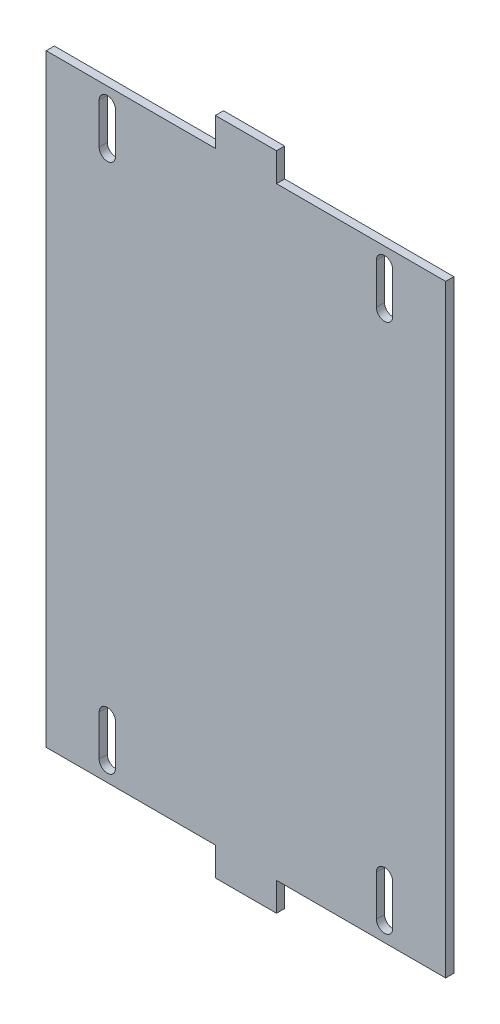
ISO-10303-21;
HEADER;
FILE_DESCRIPTION(('STEP AP214'),'2;1');
FILE_NAME('part.step','',(''),(''),'','','');
FILE_SCHEMA(('AUTOMOTIVE_DESIGN { 1 0 10303 214 1 1 1 1 }'));
ENDSEC;
DATA;
#1=APPLICATION_CONTEXT('core data for automotive mechanical design processes');
#2=APPLICATION_PROTOCOL_DEFINITION('international standard','automotive_design',2000,#1);
#3=PRODUCT_CONTEXT('',#1,'mechanical');
#4=PRODUCT('Part','Part','',(#3));
#5=PRODUCT_RELATED_PRODUCT_CATEGORY('part','',(#4));
#6=PRODUCT_DEFINITION_FORMATION('','',#4);
#7=PRODUCT_DEFINITION_CONTEXT('part definition',#1,'design');
#8=PRODUCT_DEFINITION('design','',#6,#7);
#9=PRODUCT_DEFINITION_SHAPE('','',#8);
#10=(LENGTH_UNIT() NAMED_UNIT(*) SI_UNIT(.MILLI.,.METRE.));
#11=(NAMED_UNIT(*) PLANE_ANGLE_UNIT() SI_UNIT($,.RADIAN.));
#12=(NAMED_UNIT(*) SI_UNIT($,.STERADIAN.) SOLID_ANGLE_UNIT());
#13=UNCERTAINTY_MEASURE_WITH_UNIT(LENGTH_MEASURE(1.E-05),#10,'distance_accuracy_value','');
#14=(GEOMETRIC_REPRESENTATION_CONTEXT(3) GLOBAL_UNCERTAINTY_ASSIGNED_CONTEXT((#13)) GLOBAL_UNIT_ASSIGNED_CONTEXT((#10,
#11,#12)) REPRESENTATION_CONTEXT('',''));
#15=CARTESIAN_POINT('',(0.,0.,0.));
#16=DIRECTION('',(0.,0.,1.));
#17=DIRECTION('',(1.,0.,0.));
#18=AXIS2_PLACEMENT_3D('',#15,#16,#17);
#19=CARTESIAN_POINT('',(-49.,74.,2.));
#20=DIRECTION('',(0.,-1.,0.));
#21=DIRECTION('',(0.,0.,-1.));
#22=AXIS2_PLACEMENT_3D('',#19,#20,#21);
#23=PLANE('',#22);
#24=DIRECTION('',(-1.,0.,0.));
#25=VECTOR('',#24,1.);
#26=CARTESIAN_POINT('',(-49.,74.,0.));
#27=LINE('',#26,#25);
#28=CARTESIAN_POINT('',(-7.49999999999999,74.,0.));
#29=VERTEX_POINT('',#28);
#30=CARTESIAN_POINT('',(-49.,74.,0.));
#31=VERTEX_POINT('',#30);
#32=EDGE_CURVE('E284',#29,#31,#27,.T.);
#33=ORIENTED_EDGE('',*,*,#32,.T.);
#34=DIRECTION('',(0.,0.,-1.));
#35=VECTOR('',#34,1.);
#36=CARTESIAN_POINT('',(-49.,74.,2.));
#37=LINE('',#36,#35);
#38=CARTESIAN_POINT('',(-49.,74.,2.));
#39=VERTEX_POINT('',#38);
#40=EDGE_CURVE('E373',#39,#31,#37,.T.);
#41=ORIENTED_EDGE('',*,*,#40,.F.);
#42=DIRECTION('',(-1.,0.,0.));
#43=VECTOR('',#42,1.);
#44=CARTESIAN_POINT('',(-49.,74.,2.));
#45=LINE('',#44,#43);
#46=CARTESIAN_POINT('',(-7.49999999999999,74.,2.));
#47=VERTEX_POINT('',#46);
#48=EDGE_CURVE('E315',#47,#39,#45,.T.);
#49=ORIENTED_EDGE('',*,*,#48,.F.);
#50=DIRECTION('',(0.,0.,-1.));
#51=VECTOR('',#50,1.);
#52=CARTESIAN_POINT('',(-7.49999999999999,74.,2.));
#53=LINE('',#52,#51);
#54=EDGE_CURVE('E340',#47,#29,#53,.T.);
#55=ORIENTED_EDGE('',*,*,#54,.T.);
#56=EDGE_LOOP('',(#33,#41,#49,#55));
#57=FACE_BOUND('',#56,.T.);
#58=ADVANCED_FACE('F30',(#57),#23,.F.);
#59=CARTESIAN_POINT('',(-49.,-74.,2.));
#60=DIRECTION('',(1.,0.,0.));
#61=DIRECTION('',(0.,0.,-1.));
#62=AXIS2_PLACEMENT_3D('',#59,#60,#61);
#63=PLANE('',#62);
#64=DIRECTION('',(0.,-1.,0.));
#65=VECTOR('',#64,1.);
#66=CARTESIAN_POINT('',(-49.,-74.,0.));
#67=LINE('',#66,#65);
#68=CARTESIAN_POINT('',(-49.,-74.,0.));
#69=VERTEX_POINT('',#68);
#70=EDGE_CURVE('E293',#31,#69,#67,.T.);
#71=ORIENTED_EDGE('',*,*,#70,.T.);
#72=DIRECTION('',(0.,0.,-1.));
#73=VECTOR('',#72,1.);
#74=CARTESIAN_POINT('',(-49.,-74.,2.));
#75=LINE('',#74,#73);
#76=CARTESIAN_POINT('',(-49.,-74.,2.));
#77=VERTEX_POINT('',#76);
#78=EDGE_CURVE('E370',#77,#69,#75,.T.);
#79=ORIENTED_EDGE('',*,*,#78,.F.);
#80=DIRECTION('',(0.,-1.,0.));
#81=VECTOR('',#80,1.);
#82=CARTESIAN_POINT('',(-49.,-74.,2.));
#83=LINE('',#82,#81);
#84=EDGE_CURVE('E318',#39,#77,#83,.T.);
#85=ORIENTED_EDGE('',*,*,#84,.F.);
#86=ORIENTED_EDGE('',*,*,#40,.T.);
#87=EDGE_LOOP('',(#71,#79,#85,#86));
#88=FACE_BOUND('',#87,.T.);
#89=ADVANCED_FACE('F450',(#88),#63,.F.);
#90=CARTESIAN_POINT('',(-49.,-74.,2.));
#91=DIRECTION('',(0.,1.,0.));
#92=DIRECTION('',(0.,0.,1.));
#93=AXIS2_PLACEMENT_3D('',#90,#91,#92);
#94=PLANE('',#93);
#95=DIRECTION('',(1.,0.,0.));
#96=VECTOR('',#95,1.);
#97=CARTESIAN_POINT('',(-49.,-74.,0.));
#98=LINE('',#97,#96);
#99=CARTESIAN_POINT('',(-7.49999999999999,-74.,0.));
#100=VERTEX_POINT('',#99);
#101=EDGE_CURVE('E295',#69,#100,#98,.T.);
#102=ORIENTED_EDGE('',*,*,#101,.T.);
#103=DIRECTION('',(0.,0.,-1.));
#104=VECTOR('',#103,1.);
#105=CARTESIAN_POINT('',(-7.49999999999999,-74.,2.));
#106=LINE('',#105,#104);
#107=CARTESIAN_POINT('',(-7.49999999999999,-74.,2.));
#108=VERTEX_POINT('',#107);
#109=EDGE_CURVE('E367',#108,#100,#106,.T.);
#110=ORIENTED_EDGE('',*,*,#109,.F.);
#111=DIRECTION('',(1.,0.,0.));
#112=VECTOR('',#111,1.);
#113=CARTESIAN_POINT('',(-49.,-74.,2.));
#114=LINE('',#113,#112);
#115=EDGE_CURVE('E320',#77,#108,#114,.T.);
#116=ORIENTED_EDGE('',*,*,#115,.F.);
#117=ORIENTED_EDGE('',*,*,#78,.T.);
#118=EDGE_LOOP('',(#102,#110,#116,#117));
#119=FACE_BOUND('',#118,.T.);
#120=ADVANCED_FACE('F456',(#119),#94,.F.);
#121=CARTESIAN_POINT('',(-7.49999999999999,-74.,2.));
#122=DIRECTION('',(1.,0.,0.));
#123=DIRECTION('',(0.,0.,-1.));
#124=AXIS2_PLACEMENT_3D('',#121,#122,#123);
#125=PLANE('',#124);
#126=DIRECTION('',(0.,-1.,0.));
#127=VECTOR('',#126,1.);
#128=CARTESIAN_POINT('',(-7.49999999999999,-74.,0.));
#129=LINE('',#128,#127);
#130=CARTESIAN_POINT('',(-7.49999999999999,-81.,0.));
#131=VERTEX_POINT('',#130);
#132=EDGE_CURVE('E297',#100,#131,#129,.T.);
#133=ORIENTED_EDGE('',*,*,#132,.T.);
#134=DIRECTION('',(0.,0.,-1.));
#135=VECTOR('',#134,1.);
#136=CARTESIAN_POINT('',(-7.49999999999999,-81.,2.));
#137=LINE('',#136,#135);
#138=CARTESIAN_POINT('',(-7.49999999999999,-81.,2.));
#139=VERTEX_POINT('',#138);
#140=EDGE_CURVE('E364',#139,#131,#137,.T.);
#141=ORIENTED_EDGE('',*,*,#140,.F.);
#142=DIRECTION('',(0.,-1.,0.));
#143=VECTOR('',#142,1.);
#144=CARTESIAN_POINT('',(-7.49999999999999,-74.,2.));
#145=LINE('',#144,#143);
#146=EDGE_CURVE('E322',#108,#139,#145,.T.);
#147=ORIENTED_EDGE('',*,*,#146,.F.);
#148=ORIENTED_EDGE('',*,*,#109,.T.);
#149=EDGE_LOOP('',(#133,#141,#147,#148));
#150=FACE_BOUND('',#149,.T.);
#151=ADVANCED_FACE('F544',(#150),#125,.F.);
#152=CARTESIAN_POINT('',(-7.49999999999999,-81.,2.));
#153=DIRECTION('',(0.,1.,0.));
#154=DIRECTION('',(0.,0.,1.));
#155=AXIS2_PLACEMENT_3D('',#152,#153,#154);
#156=PLANE('',#155);
#157=DIRECTION('',(1.,0.,0.));
#158=VECTOR('',#157,1.);
#159=CARTESIAN_POINT('',(-7.49999999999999,-81.,0.));
#160=LINE('',#159,#158);
#161=CARTESIAN_POINT('',(7.49999999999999,-81.,0.));
#162=VERTEX_POINT('',#161);
#163=EDGE_CURVE('E299',#131,#162,#160,.T.);
#164=ORIENTED_EDGE('',*,*,#163,.T.);
#165=DIRECTION('',(0.,0.,-1.));
#166=VECTOR('',#165,1.);
#167=CARTESIAN_POINT('',(7.49999999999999,-81.,2.));
#168=LINE('',#167,#166);
#169=CARTESIAN_POINT('',(7.49999999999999,-81.,2.));
#170=VERTEX_POINT('',#169);
#171=EDGE_CURVE('E361',#170,#162,#168,.T.);
#172=ORIENTED_EDGE('',*,*,#171,.F.);
#173=DIRECTION('',(1.,0.,0.));
#174=VECTOR('',#173,1.);
#175=CARTESIAN_POINT('',(-7.49999999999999,-81.,2.));
#176=LINE('',#175,#174);
#177=EDGE_CURVE('E324',#139,#170,#176,.T.);
#178=ORIENTED_EDGE('',*,*,#177,.F.);
#179=ORIENTED_EDGE('',*,*,#140,.T.);
#180=EDGE_LOOP('',(#164,#172,#178,#179));
#181=FACE_BOUND('',#180,.T.);
#182=ADVANCED_FACE('F540',(#181),#156,.F.);
#183=CARTESIAN_POINT('',(7.49999999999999,-74.,2.));
#184=DIRECTION('',(-1.,0.,0.));
#185=DIRECTION('',(0.,0.,1.));
#186=AXIS2_PLACEMENT_3D('',#183,#184,#185);
#187=PLANE('',#186);
#188=DIRECTION('',(0.,1.,0.));
#189=VECTOR('',#188,1.);
#190=CARTESIAN_POINT('',(7.49999999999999,-74.,0.));
#191=LINE('',#190,#189);
#192=CARTESIAN_POINT('',(7.49999999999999,-74.,0.));
#193=VERTEX_POINT('',#192);
#194=EDGE_CURVE('E301',#162,#193,#191,.T.);
#195=ORIENTED_EDGE('',*,*,#194,.T.);
#196=DIRECTION('',(0.,0.,-1.));
#197=VECTOR('',#196,1.);
#198=CARTESIAN_POINT('',(7.49999999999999,-74.,2.));
#199=LINE('',#198,#197);
#200=CARTESIAN_POINT('',(7.49999999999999,-74.,2.));
#201=VERTEX_POINT('',#200);
#202=EDGE_CURVE('E358',#201,#193,#199,.T.);
#203=ORIENTED_EDGE('',*,*,#202,.F.);
#204=DIRECTION('',(0.,1.,0.));
#205=VECTOR('',#204,1.);
#206=CARTESIAN_POINT('',(7.49999999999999,-74.,2.));
#207=LINE('',#206,#205);
#208=EDGE_CURVE('E326',#170,#201,#207,.T.);
#209=ORIENTED_EDGE('',*,*,#208,.F.);
#210=ORIENTED_EDGE('',*,*,#171,.T.);
#211=EDGE_LOOP('',(#195,#203,#209,#210));
#212=FACE_BOUND('',#211,.T.);
#213=ADVANCED_FACE('F536',(#212),#187,.F.);
#214=CARTESIAN_POINT('',(49.,-74.,2.));
#215=DIRECTION('',(0.,1.,0.));
#216=DIRECTION('',(0.,0.,1.));
#217=AXIS2_PLACEMENT_3D('',#214,#215,#216);
#218=PLANE('',#217);
#219=DIRECTION('',(1.,0.,0.));
#220=VECTOR('',#219,1.);
#221=CARTESIAN_POINT('',(49.,-74.,0.));
#222=LINE('',#221,#220);
#223=CARTESIAN_POINT('',(49.,-74.,0.));
#224=VERTEX_POINT('',#223);
#225=EDGE_CURVE('E303',#193,#224,#222,.T.);
#226=ORIENTED_EDGE('',*,*,#225,.T.);
#227=DIRECTION('',(0.,0.,-1.));
#228=VECTOR('',#227,1.);
#229=CARTESIAN_POINT('',(49.,-74.,2.));
#230=LINE('',#229,#228);
#231=CARTESIAN_POINT('',(49.,-74.,2.));
#232=VERTEX_POINT('',#231);
#233=EDGE_CURVE('E355',#232,#224,#230,.T.);
#234=ORIENTED_EDGE('',*,*,#233,.F.);
#235=DIRECTION('',(1.,0.,0.));
#236=VECTOR('',#235,1.);
#237=CARTESIAN_POINT('',(49.,-74.,2.));
#238=LINE('',#237,#236);
#239=EDGE_CURVE('E328',#201,#232,#238,.T.);
#240=ORIENTED_EDGE('',*,*,#239,.F.);
#241=ORIENTED_EDGE('',*,*,#202,.T.);
#242=EDGE_LOOP('',(#226,#234,#240,#241));
#243=FACE_BOUND('',#242,.T.);
#244=ADVANCED_FACE('F532',(#243),#218,.F.);
#245=CARTESIAN_POINT('',(49.,-74.,2.));
#246=DIRECTION('',(-1.,0.,0.));
#247=DIRECTION('',(0.,0.,1.));
#248=AXIS2_PLACEMENT_3D('',#245,#246,#247);
#249=PLANE('',#248);
#250=DIRECTION('',(0.,1.,0.));
#251=VECTOR('',#250,1.);
#252=CARTESIAN_POINT('',(49.,-74.,0.));
#253=LINE('',#252,#251);
#254=CARTESIAN_POINT('',(49.,74.,0.));
#255=VERTEX_POINT('',#254);
#256=EDGE_CURVE('E305',#224,#255,#253,.T.);
#257=ORIENTED_EDGE('',*,*,#256,.T.);
#258=DIRECTION('',(0.,0.,-1.));
#259=VECTOR('',#258,1.);
#260=CARTESIAN_POINT('',(49.,74.,2.));
#261=LINE('',#260,#259);
#262=CARTESIAN_POINT('',(49.,74.,2.));
#263=VERTEX_POINT('',#262);
#264=EDGE_CURVE('E352',#263,#255,#261,.T.);
#265=ORIENTED_EDGE('',*,*,#264,.F.);
#266=DIRECTION('',(0.,1.,0.));
#267=VECTOR('',#266,1.);
#268=CARTESIAN_POINT('',(49.,-74.,2.));
#269=LINE('',#268,#267);
#270=EDGE_CURVE('E330',#232,#263,#269,.T.);
#271=ORIENTED_EDGE('',*,*,#270,.F.);
#272=ORIENTED_EDGE('',*,*,#233,.T.);
#273=EDGE_LOOP('',(#257,#265,#271,#272));
#274=FACE_BOUND('',#273,.T.);
#275=ADVANCED_FACE('F528',(#274),#249,.F.);
#276=CARTESIAN_POINT('',(49.,74.,2.));
#277=DIRECTION('',(0.,-1.,0.));
#278=DIRECTION('',(0.,0.,-1.));
#279=AXIS2_PLACEMENT_3D('',#276,#277,#278);
#280=PLANE('',#279);
#281=DIRECTION('',(-1.,0.,0.));
#282=VECTOR('',#281,1.);
#283=CARTESIAN_POINT('',(49.,74.,0.));
#284=LINE('',#283,#282);
#285=CARTESIAN_POINT('',(7.49999999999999,74.,0.));
#286=VERTEX_POINT('',#285);
#287=EDGE_CURVE('E307',#255,#286,#284,.T.);
#288=ORIENTED_EDGE('',*,*,#287,.T.);
#289=DIRECTION('',(0.,0.,-1.));
#290=VECTOR('',#289,1.);
#291=CARTESIAN_POINT('',(7.49999999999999,74.,2.));
#292=LINE('',#291,#290);
#293=CARTESIAN_POINT('',(7.49999999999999,74.,2.));
#294=VERTEX_POINT('',#293);
#295=EDGE_CURVE('E349',#294,#286,#292,.T.);
#296=ORIENTED_EDGE('',*,*,#295,.F.);
#297=DIRECTION('',(-1.,0.,0.));
#298=VECTOR('',#297,1.);
#299=CARTESIAN_POINT('',(49.,74.,2.));
#300=LINE('',#299,#298);
#301=EDGE_CURVE('E332',#263,#294,#300,.T.);
#302=ORIENTED_EDGE('',*,*,#301,.F.);
#303=ORIENTED_EDGE('',*,*,#264,.T.);
#304=EDGE_LOOP('',(#288,#296,#302,#303));
#305=FACE_BOUND('',#304,.T.);
#306=ADVANCED_FACE('F524',(#305),#280,.F.);
#307=CARTESIAN_POINT('',(7.49999999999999,74.,2.));
#308=DIRECTION('',(-1.,0.,0.));
#309=DIRECTION('',(0.,0.,1.));
#310=AXIS2_PLACEMENT_3D('',#307,#308,#309);
#311=PLANE('',#310);
#312=DIRECTION('',(0.,1.,0.));
#313=VECTOR('',#312,1.);
#314=CARTESIAN_POINT('',(7.49999999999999,74.,0.));
#315=LINE('',#314,#313);
#316=CARTESIAN_POINT('',(7.49999999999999,81.,0.));
#317=VERTEX_POINT('',#316);
#318=EDGE_CURVE('E309',#286,#317,#315,.T.);
#319=ORIENTED_EDGE('',*,*,#318,.T.);
#320=DIRECTION('',(0.,0.,-1.));
#321=VECTOR('',#320,1.);
#322=CARTESIAN_POINT('',(7.49999999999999,81.,2.));
#323=LINE('',#322,#321);
#324=CARTESIAN_POINT('',(7.49999999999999,81.,2.));
#325=VERTEX_POINT('',#324);
#326=EDGE_CURVE('E346',#325,#317,#323,.T.);
#327=ORIENTED_EDGE('',*,*,#326,.F.);
#328=DIRECTION('',(0.,1.,0.));
#329=VECTOR('',#328,1.);
#330=CARTESIAN_POINT('',(7.49999999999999,74.,2.));
#331=LINE('',#330,#329);
#332=EDGE_CURVE('E334',#294,#325,#331,.T.);
#333=ORIENTED_EDGE('',*,*,#332,.F.);
#334=ORIENTED_EDGE('',*,*,#295,.T.);
#335=EDGE_LOOP('',(#319,#327,#333,#334));
#336=FACE_BOUND('',#335,.T.);
#337=ADVANCED_FACE('F520',(#336),#311,.F.);
#338=CARTESIAN_POINT('',(-7.49999999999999,81.,2.));
#339=DIRECTION('',(0.,-1.,0.));
#340=DIRECTION('',(0.,0.,-1.));
#341=AXIS2_PLACEMENT_3D('',#338,#339,#340);
#342=PLANE('',#341);
#343=DIRECTION('',(-1.,0.,0.));
#344=VECTOR('',#343,1.);
#345=CARTESIAN_POINT('',(-7.49999999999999,81.,0.));
#346=LINE('',#345,#344);
#347=CARTESIAN_POINT('',(-7.49999999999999,81.,0.));
#348=VERTEX_POINT('',#347);
#349=EDGE_CURVE('E311',#317,#348,#346,.T.);
#350=ORIENTED_EDGE('',*,*,#349,.T.);
#351=DIRECTION('',(0.,0.,-1.));
#352=VECTOR('',#351,1.);
#353=CARTESIAN_POINT('',(-7.49999999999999,81.,2.));
#354=LINE('',#353,#352);
#355=CARTESIAN_POINT('',(-7.49999999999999,81.,2.));
#356=VERTEX_POINT('',#355);
#357=EDGE_CURVE('E343',#356,#348,#354,.T.);
#358=ORIENTED_EDGE('',*,*,#357,.F.);
#359=DIRECTION('',(-1.,0.,0.));
#360=VECTOR('',#359,1.);
#361=CARTESIAN_POINT('',(-7.49999999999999,81.,2.));
#362=LINE('',#361,#360);
#363=EDGE_CURVE('E336',#325,#356,#362,.T.);
#364=ORIENTED_EDGE('',*,*,#363,.F.);
#365=ORIENTED_EDGE('',*,*,#326,.T.);
#366=EDGE_LOOP('',(#350,#358,#364,#365));
#367=FACE_BOUND('',#366,.T.);
#368=ADVANCED_FACE('F516',(#367),#342,.F.);
#369=CARTESIAN_POINT('',(-7.49999999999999,74.,2.));
#370=DIRECTION('',(1.,0.,0.));
#371=DIRECTION('',(0.,0.,-1.));
#372=AXIS2_PLACEMENT_3D('',#369,#370,#371);
#373=PLANE('',#372);
#374=DIRECTION('',(0.,-1.,0.));
#375=VECTOR('',#374,1.);
#376=CARTESIAN_POINT('',(-7.49999999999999,74.,0.));
#377=LINE('',#376,#375);
#378=EDGE_CURVE('E313',#348,#29,#377,.T.);
#379=ORIENTED_EDGE('',*,*,#378,.T.);
#380=ORIENTED_EDGE('',*,*,#54,.F.);
#381=DIRECTION('',(0.,-1.,0.));
#382=VECTOR('',#381,1.);
#383=CARTESIAN_POINT('',(-7.49999999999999,74.,2.));
#384=LINE('',#383,#382);
#385=EDGE_CURVE('E338',#356,#47,#384,.T.);
#386=ORIENTED_EDGE('',*,*,#385,.F.);
#387=ORIENTED_EDGE('',*,*,#357,.T.);
#388=EDGE_LOOP('',(#379,#380,#386,#387));
#389=FACE_BOUND('',#388,.T.);
#390=ADVANCED_FACE('F513',(#389),#373,.F.);
#391=CARTESIAN_POINT('',(-7.49999999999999,74.,2.));
#392=DIRECTION('',(0.,0.,1.));
#393=DIRECTION('',(1.,0.,0.));
#394=AXIS2_PLACEMENT_3D('',#391,#392,#393);
#395=PLANE('',#394);
#396=CARTESIAN_POINT('',(34.,70.,2.));
#397=DIRECTION('',(0.,0.,1.));
#398=DIRECTION('',(-1.,0.,0.));
#399=AXIS2_PLACEMENT_3D('',#396,#397,#398);
#400=CIRCLE('',#399,2.);
#401=CARTESIAN_POINT('',(36.,70.,2.));
#402=VERTEX_POINT('',#401);
#403=CARTESIAN_POINT('',(32.,70.,2.));
#404=VERTEX_POINT('',#403);
#405=EDGE_CURVE('E253',#402,#404,#400,.T.);
#406=ORIENTED_EDGE('',*,*,#405,.F.);
#407=DIRECTION('',(0.,1.,0.));
#408=VECTOR('',#407,1.);
#409=CARTESIAN_POINT('',(36.,70.,2.));
#410=LINE('',#409,#408);
#411=CARTESIAN_POINT('',(36.,60.,2.));
#412=VERTEX_POINT('',#411);
#413=EDGE_CURVE('E239',#412,#402,#410,.T.);
#414=ORIENTED_EDGE('',*,*,#413,.F.);
#415=CARTESIAN_POINT('',(34.,60.,2.));
#416=DIRECTION('',(0.,0.,1.));
#417=DIRECTION('',(1.,0.,0.));
#418=AXIS2_PLACEMENT_3D('',#415,#416,#417);
#419=CIRCLE('',#418,2.);
#420=CARTESIAN_POINT('',(32.,60.,2.));
#421=VERTEX_POINT('',#420);
#422=EDGE_CURVE('E231',#421,#412,#419,.T.);
#423=ORIENTED_EDGE('',*,*,#422,.F.);
#424=DIRECTION('',(0.,-1.,0.));
#425=VECTOR('',#424,1.);
#426=CARTESIAN_POINT('',(32.,70.,2.));
#427=LINE('',#426,#425);
#428=EDGE_CURVE('E217',#404,#421,#427,.T.);
#429=ORIENTED_EDGE('',*,*,#428,.F.);
#430=EDGE_LOOP('',(#406,#414,#423,#429));
#431=FACE_BOUND('',#430,.T.);
#432=CARTESIAN_POINT('',(-34.,70.,2.));
#433=DIRECTION('',(0.,0.,1.));
#434=DIRECTION('',(-1.,0.,0.));
#435=AXIS2_PLACEMENT_3D('',#432,#433,#434);
#436=CIRCLE('',#435,2.);
#437=CARTESIAN_POINT('',(-32.,70.,2.));
#438=VERTEX_POINT('',#437);
#439=CARTESIAN_POINT('',(-36.,70.,2.));
#440=VERTEX_POINT('',#439);
#441=EDGE_CURVE('E258',#438,#440,#436,.T.);
#442=ORIENTED_EDGE('',*,*,#441,.F.);
#443=DIRECTION('',(0.,1.,0.));
#444=VECTOR('',#443,1.);
#445=CARTESIAN_POINT('',(-32.,70.,2.));
#446=LINE('',#445,#444);
#447=CARTESIAN_POINT('',(-32.,60.,2.));
#448=VERTEX_POINT('',#447);
#449=EDGE_CURVE('E266',#448,#438,#446,.T.);
#450=ORIENTED_EDGE('',*,*,#449,.F.);
#451=CARTESIAN_POINT('',(-34.,60.,2.));
#452=DIRECTION('',(0.,0.,1.));
#453=DIRECTION('',(1.,0.,0.));
#454=AXIS2_PLACEMENT_3D('',#451,#452,#453);
#455=CIRCLE('',#454,2.);
#456=CARTESIAN_POINT('',(-36.,60.,2.));
#457=VERTEX_POINT('',#456);
#458=EDGE_CURVE('E263',#457,#448,#455,.T.);
#459=ORIENTED_EDGE('',*,*,#458,.F.);
#460=DIRECTION('',(0.,-1.,0.));
#461=VECTOR('',#460,1.);
#462=CARTESIAN_POINT('',(-36.,70.,2.));
#463=LINE('',#462,#461);
#464=EDGE_CURVE('E260',#440,#457,#463,.T.);
#465=ORIENTED_EDGE('',*,*,#464,.F.);
#466=EDGE_LOOP('',(#442,#450,#459,#465));
#467=FACE_BOUND('',#466,.T.);
#468=ORIENTED_EDGE('',*,*,#48,.T.);
#469=ORIENTED_EDGE('',*,*,#84,.T.);
#470=ORIENTED_EDGE('',*,*,#115,.T.);
#471=ORIENTED_EDGE('',*,*,#146,.T.);
#472=ORIENTED_EDGE('',*,*,#177,.T.);
#473=ORIENTED_EDGE('',*,*,#208,.T.);
#474=ORIENTED_EDGE('',*,*,#239,.T.);
#475=ORIENTED_EDGE('',*,*,#270,.T.);
#476=ORIENTED_EDGE('',*,*,#301,.T.);
#477=ORIENTED_EDGE('',*,*,#332,.T.);
#478=ORIENTED_EDGE('',*,*,#363,.T.);
#479=ORIENTED_EDGE('',*,*,#385,.T.);
#480=EDGE_LOOP('',(#468,#469,#470,#471,#472,#473,#474,#475,#476,#477,#478,#479));
#481=FACE_BOUND('',#480,.T.);
#482=CARTESIAN_POINT('',(-34.,-60.,2.));
#483=DIRECTION('',(0.,0.,1.));
#484=DIRECTION('',(-1.,0.,0.));
#485=AXIS2_PLACEMENT_3D('',#482,#483,#484);
#486=CIRCLE('',#485,2.);
#487=CARTESIAN_POINT('',(-32.,-60.,2.));
#488=VERTEX_POINT('',#487);
#489=CARTESIAN_POINT('',(-36.,-60.,2.));
#490=VERTEX_POINT('',#489);
#491=EDGE_CURVE('E376',#488,#490,#486,.T.);
#492=ORIENTED_EDGE('',*,*,#491,.F.);
#493=DIRECTION('',(0.,1.,0.));
#494=VECTOR('',#493,1.);
#495=CARTESIAN_POINT('',(-32.,-60.,2.));
#496=LINE('',#495,#494);
#497=CARTESIAN_POINT('',(-32.,-70.,2.));
#498=VERTEX_POINT('',#497);
#499=EDGE_CURVE('E378',#498,#488,#496,.T.);
#500=ORIENTED_EDGE('',*,*,#499,.F.);
#501=CARTESIAN_POINT('',(-34.,-70.,2.));
#502=DIRECTION('',(0.,0.,1.));
#503=DIRECTION('',(1.,0.,0.));
#504=AXIS2_PLACEMENT_3D('',#501,#502,#503);
#505=CIRCLE('',#504,2.);
#506=CARTESIAN_POINT('',(-36.,-70.,2.));
#507=VERTEX_POINT('',#506);
#508=EDGE_CURVE('E381',#507,#498,#505,.T.);
#509=ORIENTED_EDGE('',*,*,#508,.F.);
#510=DIRECTION('',(0.,-1.,0.));
#511=VECTOR('',#510,1.);
#512=CARTESIAN_POINT('',(-36.,-60.,2.));
#513=LINE('',#512,#511);
#514=EDGE_CURVE('E384',#490,#507,#513,.T.);
#515=ORIENTED_EDGE('',*,*,#514,.F.);
#516=EDGE_LOOP('',(#492,#500,#509,#515));
#517=FACE_BOUND('',#516,.T.);
#518=CARTESIAN_POINT('',(34.,-60.,2.));
#519=DIRECTION('',(0.,0.,1.));
#520=DIRECTION('',(-1.,0.,0.));
#521=AXIS2_PLACEMENT_3D('',#518,#519,#520);
#522=CIRCLE('',#521,2.);
#523=CARTESIAN_POINT('',(36.,-60.,2.));
#524=VERTEX_POINT('',#523);
#525=CARTESIAN_POINT('',(32.,-60.,2.));
#526=VERTEX_POINT('',#525);
#527=EDGE_CURVE('E408',#524,#526,#522,.T.);
#528=ORIENTED_EDGE('',*,*,#527,.F.);
#529=DIRECTION('',(0.,1.,0.));
#530=VECTOR('',#529,1.);
#531=CARTESIAN_POINT('',(36.,-60.,2.));
#532=LINE('',#531,#530);
#533=CARTESIAN_POINT('',(36.,-70.,2.));
#534=VERTEX_POINT('',#533);
#535=EDGE_CURVE('E410',#534,#524,#532,.T.);
#536=ORIENTED_EDGE('',*,*,#535,.F.);
#537=CARTESIAN_POINT('',(34.,-70.,2.));
#538=DIRECTION('',(0.,0.,1.));
#539=DIRECTION('',(1.,0.,0.));
#540=AXIS2_PLACEMENT_3D('',#537,#538,#539);
#541=CIRCLE('',#540,2.);
#542=CARTESIAN_POINT('',(32.,-70.,2.));
#543=VERTEX_POINT('',#542);
#544=EDGE_CURVE('E413',#543,#534,#541,.T.);
#545=ORIENTED_EDGE('',*,*,#544,.F.);
#546=DIRECTION('',(0.,-1.,0.));
#547=VECTOR('',#546,1.);
#548=CARTESIAN_POINT('',(32.,-60.,2.));
#549=LINE('',#548,#547);
#550=EDGE_CURVE('E416',#526,#543,#549,.T.);
#551=ORIENTED_EDGE('',*,*,#550,.F.);
#552=EDGE_LOOP('',(#528,#536,#545,#551));
#553=FACE_BOUND('',#552,.T.);
#554=ADVANCED_FACE('F237',(#431,#467,#481,#517,#553),#395,.T.);
#555=CARTESIAN_POINT('',(-7.49999999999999,74.,0.));
#556=DIRECTION('',(0.,0.,1.));
#557=DIRECTION('',(1.,0.,0.));
#558=AXIS2_PLACEMENT_3D('',#555,#556,#557);
#559=PLANE('',#558);
#560=DIRECTION('',(0.,1.,0.));
#561=VECTOR('',#560,1.);
#562=CARTESIAN_POINT('',(36.,70.,0.));
#563=LINE('',#562,#561);
#564=CARTESIAN_POINT('',(36.,60.,0.));
#565=VERTEX_POINT('',#564);
#566=CARTESIAN_POINT('',(36.,70.,0.));
#567=VERTEX_POINT('',#566);
#568=EDGE_CURVE('E250',#565,#567,#563,.T.);
#569=ORIENTED_EDGE('',*,*,#568,.T.);
#570=CARTESIAN_POINT('',(34.,70.,0.));
#571=DIRECTION('',(0.,0.,1.));
#572=DIRECTION('',(-1.,0.,0.));
#573=AXIS2_PLACEMENT_3D('',#570,#571,#572);
#574=CIRCLE('',#573,2.);
#575=CARTESIAN_POINT('',(32.,70.,0.));
#576=VERTEX_POINT('',#575);
#577=EDGE_CURVE('E255',#567,#576,#574,.T.);
#578=ORIENTED_EDGE('',*,*,#577,.T.);
#579=DIRECTION('',(0.,-1.,0.));
#580=VECTOR('',#579,1.);
#581=CARTESIAN_POINT('',(32.,70.,0.));
#582=LINE('',#581,#580);
#583=CARTESIAN_POINT('',(32.,60.,0.));
#584=VERTEX_POINT('',#583);
#585=EDGE_CURVE('E227',#576,#584,#582,.T.);
#586=ORIENTED_EDGE('',*,*,#585,.T.);
#587=CARTESIAN_POINT('',(34.,60.,0.));
#588=DIRECTION('',(0.,0.,1.));
#589=DIRECTION('',(1.,0.,0.));
#590=AXIS2_PLACEMENT_3D('',#587,#588,#589);
#591=CIRCLE('',#590,2.);
#592=EDGE_CURVE('E234',#584,#565,#591,.T.);
#593=ORIENTED_EDGE('',*,*,#592,.T.);
#594=EDGE_LOOP('',(#569,#578,#586,#593));
#595=FACE_BOUND('',#594,.T.);
#596=DIRECTION('',(0.,1.,0.));
#597=VECTOR('',#596,1.);
#598=CARTESIAN_POINT('',(-32.,70.,0.));
#599=LINE('',#598,#597);
#600=CARTESIAN_POINT('',(-32.,60.,0.));
#601=VERTEX_POINT('',#600);
#602=CARTESIAN_POINT('',(-32.,70.,0.));
#603=VERTEX_POINT('',#602);
#604=EDGE_CURVE('E278',#601,#603,#599,.T.);
#605=ORIENTED_EDGE('',*,*,#604,.T.);
#606=CARTESIAN_POINT('',(-34.,70.,0.));
#607=DIRECTION('',(0.,0.,1.));
#608=DIRECTION('',(-1.,0.,0.));
#609=AXIS2_PLACEMENT_3D('',#606,#607,#608);
#610=CIRCLE('',#609,2.);
#611=CARTESIAN_POINT('',(-36.,70.,0.));
#612=VERTEX_POINT('',#611);
#613=EDGE_CURVE('E269',#603,#612,#610,.T.);
#614=ORIENTED_EDGE('',*,*,#613,.T.);
#615=DIRECTION('',(0.,-1.,0.));
#616=VECTOR('',#615,1.);
#617=CARTESIAN_POINT('',(-36.,70.,0.));
#618=LINE('',#617,#616);
#619=CARTESIAN_POINT('',(-36.,60.,0.));
#620=VERTEX_POINT('',#619);
#621=EDGE_CURVE('E272',#612,#620,#618,.T.);
#622=ORIENTED_EDGE('',*,*,#621,.T.);
#623=CARTESIAN_POINT('',(-34.,60.,0.));
#624=DIRECTION('',(0.,0.,1.));
#625=DIRECTION('',(1.,0.,0.));
#626=AXIS2_PLACEMENT_3D('',#623,#624,#625);
#627=CIRCLE('',#626,2.);
#628=EDGE_CURVE('E275',#620,#601,#627,.T.);
#629=ORIENTED_EDGE('',*,*,#628,.T.);
#630=EDGE_LOOP('',(#605,#614,#622,#629));
#631=FACE_BOUND('',#630,.T.);
#632=ORIENTED_EDGE('',*,*,#32,.F.);
#633=ORIENTED_EDGE('',*,*,#378,.F.);
#634=ORIENTED_EDGE('',*,*,#349,.F.);
#635=ORIENTED_EDGE('',*,*,#318,.F.);
#636=ORIENTED_EDGE('',*,*,#287,.F.);
#637=ORIENTED_EDGE('',*,*,#256,.F.);
#638=ORIENTED_EDGE('',*,*,#225,.F.);
#639=ORIENTED_EDGE('',*,*,#194,.F.);
#640=ORIENTED_EDGE('',*,*,#163,.F.);
#641=ORIENTED_EDGE('',*,*,#132,.F.);
#642=ORIENTED_EDGE('',*,*,#101,.F.);
#643=ORIENTED_EDGE('',*,*,#70,.F.);
#644=EDGE_LOOP('',(#632,#633,#634,#635,#636,#637,#638,#639,#640,#641,#642,#643));
#645=FACE_BOUND('',#644,.T.);
#646=CARTESIAN_POINT('',(-34.,-60.,0.));
#647=DIRECTION('',(0.,0.,1.));
#648=DIRECTION('',(-1.,0.,0.));
#649=AXIS2_PLACEMENT_3D('',#646,#647,#648);
#650=CIRCLE('',#649,2.);
#651=CARTESIAN_POINT('',(-32.,-60.,0.));
#652=VERTEX_POINT('',#651);
#653=CARTESIAN_POINT('',(-36.,-60.,0.));
#654=VERTEX_POINT('',#653);
#655=EDGE_CURVE('E387',#652,#654,#650,.T.);
#656=ORIENTED_EDGE('',*,*,#655,.T.);
#657=DIRECTION('',(0.,-1.,0.));
#658=VECTOR('',#657,1.);
#659=CARTESIAN_POINT('',(-36.,-60.,0.));
#660=LINE('',#659,#658);
#661=CARTESIAN_POINT('',(-36.,-70.,0.));
#662=VERTEX_POINT('',#661);
#663=EDGE_CURVE('E389',#654,#662,#660,.T.);
#664=ORIENTED_EDGE('',*,*,#663,.T.);
#665=CARTESIAN_POINT('',(-34.,-70.,0.));
#666=DIRECTION('',(0.,0.,1.));
#667=DIRECTION('',(1.,0.,0.));
#668=AXIS2_PLACEMENT_3D('',#665,#666,#667);
#669=CIRCLE('',#668,2.);
#670=CARTESIAN_POINT('',(-32.,-70.,0.));
#671=VERTEX_POINT('',#670);
#672=EDGE_CURVE('E391',#662,#671,#669,.T.);
#673=ORIENTED_EDGE('',*,*,#672,.T.);
#674=DIRECTION('',(0.,1.,0.));
#675=VECTOR('',#674,1.);
#676=CARTESIAN_POINT('',(-32.,-60.,0.));
#677=LINE('',#676,#675);
#678=EDGE_CURVE('E393',#671,#652,#677,.T.);
#679=ORIENTED_EDGE('',*,*,#678,.T.);
#680=EDGE_LOOP('',(#656,#664,#673,#679));
#681=FACE_BOUND('',#680,.T.);
#682=CARTESIAN_POINT('',(34.,-60.,0.));
#683=DIRECTION('',(0.,0.,1.));
#684=DIRECTION('',(-1.,0.,0.));
#685=AXIS2_PLACEMENT_3D('',#682,#683,#684);
#686=CIRCLE('',#685,2.);
#687=CARTESIAN_POINT('',(36.,-60.,0.));
#688=VERTEX_POINT('',#687);
#689=CARTESIAN_POINT('',(32.,-60.,0.));
#690=VERTEX_POINT('',#689);
#691=EDGE_CURVE('E45',#688,#690,#686,.T.);
#692=ORIENTED_EDGE('',*,*,#691,.T.);
#693=DIRECTION('',(0.,-1.,0.));
#694=VECTOR('',#693,1.);
#695=CARTESIAN_POINT('',(32.,-60.,0.));
#696=LINE('',#695,#694);
#697=CARTESIAN_POINT('',(32.,-70.,0.));
#698=VERTEX_POINT('',#697);
#699=EDGE_CURVE('E420',#690,#698,#696,.T.);
#700=ORIENTED_EDGE('',*,*,#699,.T.);
#701=CARTESIAN_POINT('',(34.,-70.,0.));
#702=DIRECTION('',(0.,0.,1.));
#703=DIRECTION('',(1.,0.,0.));
#704=AXIS2_PLACEMENT_3D('',#701,#702,#703);
#705=CIRCLE('',#704,2.);
#706=CARTESIAN_POINT('',(36.,-70.,0.));
#707=VERTEX_POINT('',#706);
#708=EDGE_CURVE('E52',#698,#707,#705,.T.);
#709=ORIENTED_EDGE('',*,*,#708,.T.);
#710=DIRECTION('',(0.,1.,0.));
#711=VECTOR('',#710,1.);
#712=CARTESIAN_POINT('',(36.,-60.,0.));
#713=LINE('',#712,#711);
#714=EDGE_CURVE('E423',#707,#688,#713,.T.);
#715=ORIENTED_EDGE('',*,*,#714,.T.);
#716=EDGE_LOOP('',(#692,#700,#709,#715));
#717=FACE_BOUND('',#716,.T.);
#718=ADVANCED_FACE('F507',(#595,#631,#645,#681,#717),#559,.F.);
#719=CARTESIAN_POINT('',(-34.,70.,0.));
#720=DIRECTION('',(0.,0.,1.));
#721=DIRECTION('',(1.,0.,0.));
#722=AXIS2_PLACEMENT_3D('',#719,#720,#721);
#723=CYLINDRICAL_SURFACE('',#722,2.);
#724=ORIENTED_EDGE('',*,*,#441,.T.);
#725=DIRECTION('',(0.,0.,1.));
#726=VECTOR('',#725,1.);
#727=CARTESIAN_POINT('',(-36.,70.,0.));
#728=LINE('',#727,#726);
#729=EDGE_CURVE('E281',#612,#440,#728,.T.);
#730=ORIENTED_EDGE('',*,*,#729,.F.);
#731=ORIENTED_EDGE('',*,*,#613,.F.);
#732=DIRECTION('',(0.,0.,1.));
#733=VECTOR('',#732,1.);
#734=CARTESIAN_POINT('',(-32.,70.,0.));
#735=LINE('',#734,#733);
#736=EDGE_CURVE('E282',#603,#438,#735,.T.);
#737=ORIENTED_EDGE('',*,*,#736,.T.);
#738=EDGE_LOOP('',(#724,#730,#731,#737));
#739=FACE_BOUND('',#738,.T.);
#740=ADVANCED_FACE('F500',(#739),#723,.F.);
#741=CARTESIAN_POINT('',(-32.,70.,0.));
#742=DIRECTION('',(1.,0.,0.));
#743=DIRECTION('',(0.,0.,-1.));
#744=AXIS2_PLACEMENT_3D('',#741,#742,#743);
#745=PLANE('',#744);
#746=ORIENTED_EDGE('',*,*,#449,.T.);
#747=ORIENTED_EDGE('',*,*,#736,.F.);
#748=ORIENTED_EDGE('',*,*,#604,.F.);
#749=DIRECTION('',(0.,0.,1.));
#750=VECTOR('',#749,1.);
#751=CARTESIAN_POINT('',(-32.,60.,0.));
#752=LINE('',#751,#750);
#753=EDGE_CURVE('E285',#601,#448,#752,.T.);
#754=ORIENTED_EDGE('',*,*,#753,.T.);
#755=EDGE_LOOP('',(#746,#747,#748,#754));
#756=FACE_BOUND('',#755,.T.);
#757=ADVANCED_FACE('F497',(#756),#745,.F.);
#758=CARTESIAN_POINT('',(-34.,60.,0.));
#759=DIRECTION('',(0.,0.,1.));
#760=DIRECTION('',(1.,0.,0.));
#761=AXIS2_PLACEMENT_3D('',#758,#759,#760);
#762=CYLINDRICAL_SURFACE('',#761,2.);
#763=ORIENTED_EDGE('',*,*,#458,.T.);
#764=ORIENTED_EDGE('',*,*,#753,.F.);
#765=ORIENTED_EDGE('',*,*,#628,.F.);
#766=DIRECTION('',(0.,0.,1.));
#767=VECTOR('',#766,1.);
#768=CARTESIAN_POINT('',(-36.,60.,0.));
#769=LINE('',#768,#767);
#770=EDGE_CURVE('E287',#620,#457,#769,.T.);
#771=ORIENTED_EDGE('',*,*,#770,.T.);
#772=EDGE_LOOP('',(#763,#764,#765,#771));
#773=FACE_BOUND('',#772,.T.);
#774=ADVANCED_FACE('F492',(#773),#762,.F.);
#775=CARTESIAN_POINT('',(-36.,70.,0.));
#776=DIRECTION('',(-1.,0.,0.));
#777=DIRECTION('',(0.,0.,1.));
#778=AXIS2_PLACEMENT_3D('',#775,#776,#777);
#779=PLANE('',#778);
#780=ORIENTED_EDGE('',*,*,#464,.T.);
#781=ORIENTED_EDGE('',*,*,#770,.F.);
#782=ORIENTED_EDGE('',*,*,#621,.F.);
#783=ORIENTED_EDGE('',*,*,#729,.T.);
#784=EDGE_LOOP('',(#780,#781,#782,#783));
#785=FACE_BOUND('',#784,.T.);
#786=ADVANCED_FACE('F480',(#785),#779,.F.);
#787=CARTESIAN_POINT('',(34.,70.,0.));
#788=DIRECTION('',(0.,0.,1.));
#789=DIRECTION('',(1.,0.,0.));
#790=AXIS2_PLACEMENT_3D('',#787,#788,#789);
#791=CYLINDRICAL_SURFACE('',#790,2.);
#792=ORIENTED_EDGE('',*,*,#405,.T.);
#793=DIRECTION('',(0.,0.,1.));
#794=VECTOR('',#793,1.);
#795=CARTESIAN_POINT('',(32.,70.,0.));
#796=LINE('',#795,#794);
#797=EDGE_CURVE('E223',#576,#404,#796,.T.);
#798=ORIENTED_EDGE('',*,*,#797,.F.);
#799=ORIENTED_EDGE('',*,*,#577,.F.);
#800=DIRECTION('',(0.,0.,1.));
#801=VECTOR('',#800,1.);
#802=CARTESIAN_POINT('',(36.,70.,0.));
#803=LINE('',#802,#801);
#804=EDGE_CURVE('E247',#567,#402,#803,.T.);
#805=ORIENTED_EDGE('',*,*,#804,.T.);
#806=EDGE_LOOP('',(#792,#798,#799,#805));
#807=FACE_BOUND('',#806,.T.);
#808=ADVANCED_FACE('F475',(#807),#791,.F.);
#809=CARTESIAN_POINT('',(36.,70.,0.));
#810=DIRECTION('',(1.,0.,0.));
#811=DIRECTION('',(0.,0.,-1.));
#812=AXIS2_PLACEMENT_3D('',#809,#810,#811);
#813=PLANE('',#812);
#814=ORIENTED_EDGE('',*,*,#413,.T.);
#815=ORIENTED_EDGE('',*,*,#804,.F.);
#816=ORIENTED_EDGE('',*,*,#568,.F.);
#817=DIRECTION('',(0.,0.,1.));
#818=VECTOR('',#817,1.);
#819=CARTESIAN_POINT('',(36.,60.,0.));
#820=LINE('',#819,#818);
#821=EDGE_CURVE('E240',#565,#412,#820,.T.);
#822=ORIENTED_EDGE('',*,*,#821,.T.);
#823=EDGE_LOOP('',(#814,#815,#816,#822));
#824=FACE_BOUND('',#823,.T.);
#825=ADVANCED_FACE('F482',(#824),#813,.F.);
#826=CARTESIAN_POINT('',(34.,60.,0.));
#827=DIRECTION('',(0.,0.,1.));
#828=DIRECTION('',(1.,0.,0.));
#829=AXIS2_PLACEMENT_3D('',#826,#827,#828);
#830=CYLINDRICAL_SURFACE('',#829,2.);
#831=ORIENTED_EDGE('',*,*,#422,.T.);
#832=ORIENTED_EDGE('',*,*,#821,.F.);
#833=ORIENTED_EDGE('',*,*,#592,.F.);
#834=DIRECTION('',(0.,0.,1.));
#835=VECTOR('',#834,1.);
#836=CARTESIAN_POINT('',(32.,60.,0.));
#837=LINE('',#836,#835);
#838=EDGE_CURVE('E220',#584,#421,#837,.T.);
#839=ORIENTED_EDGE('',*,*,#838,.T.);
#840=EDGE_LOOP('',(#831,#832,#833,#839));
#841=FACE_BOUND('',#840,.T.);
#842=ADVANCED_FACE('F230',(#841),#830,.F.);
#843=CARTESIAN_POINT('',(32.,70.,0.));
#844=DIRECTION('',(-1.,0.,0.));
#845=DIRECTION('',(0.,0.,1.));
#846=AXIS2_PLACEMENT_3D('',#843,#844,#845);
#847=PLANE('',#846);
#848=ORIENTED_EDGE('',*,*,#428,.T.);
#849=ORIENTED_EDGE('',*,*,#838,.F.);
#850=ORIENTED_EDGE('',*,*,#585,.F.);
#851=ORIENTED_EDGE('',*,*,#797,.T.);
#852=EDGE_LOOP('',(#848,#849,#850,#851));
#853=FACE_BOUND('',#852,.T.);
#854=ADVANCED_FACE('F219',(#853),#847,.F.);
#855=CARTESIAN_POINT('',(-36.,-60.,0.));
#856=DIRECTION('',(-1.,0.,0.));
#857=DIRECTION('',(0.,0.,1.));
#858=AXIS2_PLACEMENT_3D('',#855,#856,#857);
#859=PLANE('',#858);
#860=ORIENTED_EDGE('',*,*,#514,.T.);
#861=DIRECTION('',(0.,0.,1.));
#862=VECTOR('',#861,1.);
#863=CARTESIAN_POINT('',(-36.,-70.,0.));
#864=LINE('',#863,#862);
#865=EDGE_CURVE('E405',#662,#507,#864,.T.);
#866=ORIENTED_EDGE('',*,*,#865,.F.);
#867=ORIENTED_EDGE('',*,*,#663,.F.);
#868=DIRECTION('',(0.,0.,1.));
#869=VECTOR('',#868,1.);
#870=CARTESIAN_POINT('',(-36.,-60.,0.));
#871=LINE('',#870,#869);
#872=EDGE_CURVE('E396',#654,#490,#871,.T.);
#873=ORIENTED_EDGE('',*,*,#872,.T.);
#874=EDGE_LOOP('',(#860,#866,#867,#873));
#875=FACE_BOUND('',#874,.T.);
#876=ADVANCED_FACE('F471',(#875),#859,.F.);
#877=CARTESIAN_POINT('',(-34.,-70.,0.));
#878=DIRECTION('',(0.,0.,1.));
#879=DIRECTION('',(1.,0.,0.));
#880=AXIS2_PLACEMENT_3D('',#877,#878,#879);
#881=CYLINDRICAL_SURFACE('',#880,2.);
#882=ORIENTED_EDGE('',*,*,#508,.T.);
#883=DIRECTION('',(0.,0.,1.));
#884=VECTOR('',#883,1.);
#885=CARTESIAN_POINT('',(-32.,-70.,0.));
#886=LINE('',#885,#884);
#887=EDGE_CURVE('E402',#671,#498,#886,.T.);
#888=ORIENTED_EDGE('',*,*,#887,.F.);
#889=ORIENTED_EDGE('',*,*,#672,.F.);
#890=ORIENTED_EDGE('',*,*,#865,.T.);
#891=EDGE_LOOP('',(#882,#888,#889,#890));
#892=FACE_BOUND('',#891,.T.);
#893=ADVANCED_FACE('F468',(#892),#881,.F.);
#894=CARTESIAN_POINT('',(-32.,-60.,0.));
#895=DIRECTION('',(1.,0.,0.));
#896=DIRECTION('',(0.,0.,-1.));
#897=AXIS2_PLACEMENT_3D('',#894,#895,#896);
#898=PLANE('',#897);
#899=ORIENTED_EDGE('',*,*,#499,.T.);
#900=DIRECTION('',(0.,0.,1.));
#901=VECTOR('',#900,1.);
#902=CARTESIAN_POINT('',(-32.,-60.,0.));
#903=LINE('',#902,#901);
#904=EDGE_CURVE('E399',#652,#488,#903,.T.);
#905=ORIENTED_EDGE('',*,*,#904,.F.);
#906=ORIENTED_EDGE('',*,*,#678,.F.);
#907=ORIENTED_EDGE('',*,*,#887,.T.);
#908=EDGE_LOOP('',(#899,#905,#906,#907));
#909=FACE_BOUND('',#908,.T.);
#910=ADVANCED_FACE('F464',(#909),#898,.F.);
#911=CARTESIAN_POINT('',(-34.,-60.,0.));
#912=DIRECTION('',(0.,0.,1.));
#913=DIRECTION('',(1.,0.,0.));
#914=AXIS2_PLACEMENT_3D('',#911,#912,#913);
#915=CYLINDRICAL_SURFACE('',#914,2.);
#916=ORIENTED_EDGE('',*,*,#491,.T.);
#917=ORIENTED_EDGE('',*,*,#872,.F.);
#918=ORIENTED_EDGE('',*,*,#655,.F.);
#919=ORIENTED_EDGE('',*,*,#904,.T.);
#920=EDGE_LOOP('',(#916,#917,#918,#919));
#921=FACE_BOUND('',#920,.T.);
#922=ADVANCED_FACE('F461',(#921),#915,.F.);
#923=CARTESIAN_POINT('',(32.,-60.,0.));
#924=DIRECTION('',(-1.,0.,0.));
#925=DIRECTION('',(0.,0.,1.));
#926=AXIS2_PLACEMENT_3D('',#923,#924,#925);
#927=PLANE('',#926);
#928=ORIENTED_EDGE('',*,*,#550,.T.);
#929=DIRECTION('',(0.,0.,1.));
#930=VECTOR('',#929,1.);
#931=CARTESIAN_POINT('',(32.,-70.,0.));
#932=LINE('',#931,#930);
#933=EDGE_CURVE('E11',#698,#543,#932,.T.);
#934=ORIENTED_EDGE('',*,*,#933,.F.);
#935=ORIENTED_EDGE('',*,*,#699,.F.);
#936=DIRECTION('',(0.,0.,1.));
#937=VECTOR('',#936,1.);
#938=CARTESIAN_POINT('',(32.,-60.,0.));
#939=LINE('',#938,#937);
#940=EDGE_CURVE('E425',#690,#526,#939,.T.);
#941=ORIENTED_EDGE('',*,*,#940,.T.);
#942=EDGE_LOOP('',(#928,#934,#935,#941));
#943=FACE_BOUND('',#942,.T.);
#944=ADVANCED_FACE('F32',(#943),#927,.F.);
#945=CARTESIAN_POINT('',(34.,-70.,0.));
#946=DIRECTION('',(0.,0.,1.));
#947=DIRECTION('',(1.,0.,0.));
#948=AXIS2_PLACEMENT_3D('',#945,#946,#947);
#949=CYLINDRICAL_SURFACE('',#948,2.);
#950=ORIENTED_EDGE('',*,*,#544,.T.);
#951=DIRECTION('',(0.,0.,1.));
#952=VECTOR('',#951,1.);
#953=CARTESIAN_POINT('',(36.,-70.,0.));
#954=LINE('',#953,#952);
#955=EDGE_CURVE('E38',#707,#534,#954,.T.);
#956=ORIENTED_EDGE('',*,*,#955,.F.);
#957=ORIENTED_EDGE('',*,*,#708,.F.);
#958=ORIENTED_EDGE('',*,*,#933,.T.);
#959=EDGE_LOOP('',(#950,#956,#957,#958));
#960=FACE_BOUND('',#959,.T.);
#961=ADVANCED_FACE('F435',(#960),#949,.F.);
#962=CARTESIAN_POINT('',(36.,-60.,0.));
#963=DIRECTION('',(1.,0.,0.));
#964=DIRECTION('',(0.,0.,-1.));
#965=AXIS2_PLACEMENT_3D('',#962,#963,#964);
#966=PLANE('',#965);
#967=ORIENTED_EDGE('',*,*,#535,.T.);
#968=DIRECTION('',(0.,0.,1.));
#969=VECTOR('',#968,1.);
#970=CARTESIAN_POINT('',(36.,-60.,0.));
#971=LINE('',#970,#969);
#972=EDGE_CURVE('E428',#688,#524,#971,.T.);
#973=ORIENTED_EDGE('',*,*,#972,.F.);
#974=ORIENTED_EDGE('',*,*,#714,.F.);
#975=ORIENTED_EDGE('',*,*,#955,.T.);
#976=EDGE_LOOP('',(#967,#973,#974,#975));
#977=FACE_BOUND('',#976,.T.);
#978=ADVANCED_FACE('F432',(#977),#966,.F.);
#979=CARTESIAN_POINT('',(34.,-60.,0.));
#980=DIRECTION('',(0.,0.,1.));
#981=DIRECTION('',(1.,0.,0.));
#982=AXIS2_PLACEMENT_3D('',#979,#980,#981);
#983=CYLINDRICAL_SURFACE('',#982,2.);
#984=ORIENTED_EDGE('',*,*,#527,.T.);
#985=ORIENTED_EDGE('',*,*,#940,.F.);
#986=ORIENTED_EDGE('',*,*,#691,.F.);
#987=ORIENTED_EDGE('',*,*,#972,.T.);
#988=EDGE_LOOP('',(#984,#985,#986,#987));
#989=FACE_BOUND('',#988,.T.);
#990=ADVANCED_FACE('F441',(#989),#983,.F.);
#991=CLOSED_SHELL('',(#58,#89,#120,#151,#182,#213,#244,#275,#306,#337,#368,#390,#554,#718,#740,
#757,#774,#786,#808,#825,#842,#854,#876,#893,#910,#922,#944,#961,#978,#990));
#992=MANIFOLD_SOLID_BREP('B2',#991);
#993=ADVANCED_BREP_SHAPE_REPRESENTATION('',(#18,#992),#14);
#994=SHAPE_DEFINITION_REPRESENTATION(#9,#993);
ENDSEC;
END-ISO-10303-21;
